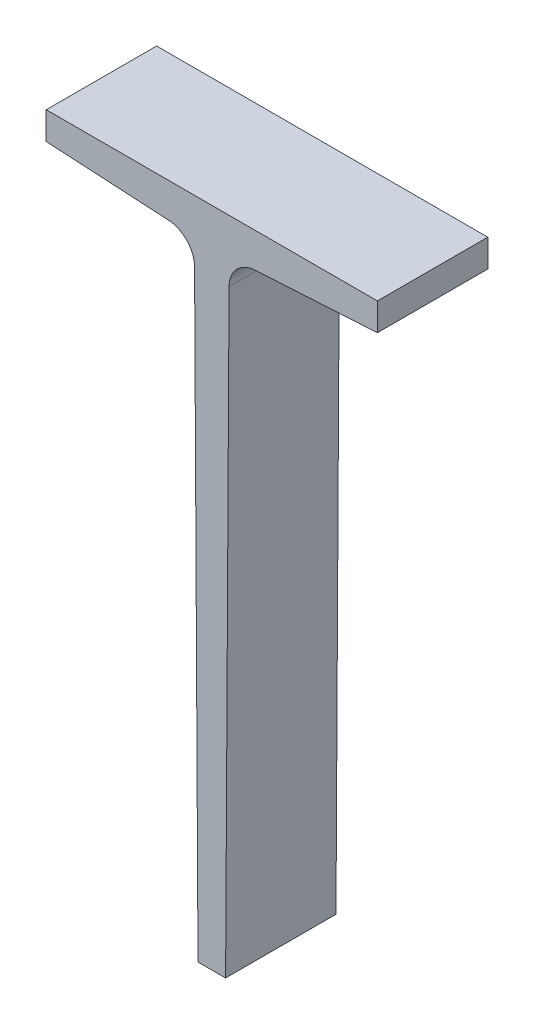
ISO-10303-21;
HEADER;
FILE_DESCRIPTION(('STEP AP214'),'2;1');
FILE_NAME('part.step','',(''),(''),'','','');
FILE_SCHEMA(('AUTOMOTIVE_DESIGN { 1 0 10303 214 1 1 1 1 }'));
ENDSEC;
DATA;
#1=APPLICATION_CONTEXT('core data for automotive mechanical design processes');
#2=APPLICATION_PROTOCOL_DEFINITION('international standard','automotive_design',2000,#1);
#3=PRODUCT_CONTEXT('',#1,'mechanical');
#4=PRODUCT('Part','Part','',(#3));
#5=PRODUCT_RELATED_PRODUCT_CATEGORY('part','',(#4));
#6=PRODUCT_DEFINITION_FORMATION('','',#4);
#7=PRODUCT_DEFINITION_CONTEXT('part definition',#1,'design');
#8=PRODUCT_DEFINITION('design','',#6,#7);
#9=PRODUCT_DEFINITION_SHAPE('','',#8);
#10=(LENGTH_UNIT() NAMED_UNIT(*) SI_UNIT(.MILLI.,.METRE.));
#11=(NAMED_UNIT(*) PLANE_ANGLE_UNIT() SI_UNIT($,.RADIAN.));
#12=(NAMED_UNIT(*) SI_UNIT($,.STERADIAN.) SOLID_ANGLE_UNIT());
#13=UNCERTAINTY_MEASURE_WITH_UNIT(LENGTH_MEASURE(1.E-05),#10,'distance_accuracy_value','');
#14=(GEOMETRIC_REPRESENTATION_CONTEXT(3) GLOBAL_UNCERTAINTY_ASSIGNED_CONTEXT((#13)) GLOBAL_UNIT_ASSIGNED_CONTEXT((#10,
#11,#12)) REPRESENTATION_CONTEXT('',''));
#15=CARTESIAN_POINT('',(0.,0.,0.));
#16=DIRECTION('',(0.,0.,1.));
#17=DIRECTION('',(1.,0.,0.));
#18=AXIS2_PLACEMENT_3D('',#15,#16,#17);
#19=CARTESIAN_POINT('',(0.,0.,12.7));
#20=DIRECTION('',(1.,0.,0.));
#21=DIRECTION('',(0.,1.,0.));
#22=AXIS2_PLACEMENT_3D('',#19,#20,#21);
#23=PLANE('',#22);
#24=DIRECTION('',(0.,-1.,0.));
#25=VECTOR('',#24,1.);
#26=CARTESIAN_POINT('',(0.,0.,-12.7));
#27=LINE('',#26,#25);
#28=CARTESIAN_POINT('',(0.,0.,-12.7));
#29=VERTEX_POINT('',#28);
#30=CARTESIAN_POINT('',(0.,-6.35,-12.7));
#31=VERTEX_POINT('',#30);
#32=EDGE_CURVE('E140',#29,#31,#27,.T.);
#33=ORIENTED_EDGE('',*,*,#32,.T.);
#34=DIRECTION('',(0.,0.,-1.));
#35=VECTOR('',#34,1.);
#36=CARTESIAN_POINT('',(0.,-6.35,12.7));
#37=LINE('',#36,#35);
#38=CARTESIAN_POINT('',(0.,-6.35,12.7));
#39=VERTEX_POINT('',#38);
#40=EDGE_CURVE('E11',#39,#31,#37,.T.);
#41=ORIENTED_EDGE('',*,*,#40,.F.);
#42=DIRECTION('',(0.,-1.,0.));
#43=VECTOR('',#42,1.);
#44=CARTESIAN_POINT('',(0.,0.,12.7));
#45=LINE('',#44,#43);
#46=CARTESIAN_POINT('',(0.,0.,12.7));
#47=VERTEX_POINT('',#46);
#48=EDGE_CURVE('E92',#47,#39,#45,.T.);
#49=ORIENTED_EDGE('',*,*,#48,.F.);
#50=DIRECTION('',(0.,0.,-1.));
#51=VECTOR('',#50,1.);
#52=CARTESIAN_POINT('',(0.,0.,12.7));
#53=LINE('',#52,#51);
#54=EDGE_CURVE('E49',#47,#29,#53,.T.);
#55=ORIENTED_EDGE('',*,*,#54,.T.);
#56=EDGE_LOOP('',(#33,#41,#49,#55));
#57=FACE_BOUND('',#56,.T.);
#58=ADVANCED_FACE('F33',(#57),#23,.F.);
#59=CARTESIAN_POINT('',(28.1390295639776,-7.9375,12.7));
#60=DIRECTION('',(-0.056326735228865,-0.998412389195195,0.));
#61=DIRECTION('',(0.998412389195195,-0.056326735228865,0.));
#62=AXIS2_PLACEMENT_3D('',#59,#60,#61);
#63=PLANE('',#62);
#64=DIRECTION('',(-0.998412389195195,0.056326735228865,0.));
#65=VECTOR('',#64,1.);
#66=CARTESIAN_POINT('',(28.1390295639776,-7.9375,-12.7));
#67=LINE('',#66,#65);
#68=CARTESIAN_POINT('',(28.1390295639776,-7.9375,-12.7));
#69=VERTEX_POINT('',#68);
#70=EDGE_CURVE('E142',#69,#31,#67,.T.);
#71=ORIENTED_EDGE('',*,*,#70,.F.);
#72=DIRECTION('',(0.,0.,-1.));
#73=VECTOR('',#72,1.);
#74=CARTESIAN_POINT('',(28.1390295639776,-7.9375,12.7));
#75=LINE('',#74,#73);
#76=CARTESIAN_POINT('',(28.1390295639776,-7.9375,12.7));
#77=VERTEX_POINT('',#76);
#78=EDGE_CURVE('E41',#77,#69,#75,.T.);
#79=ORIENTED_EDGE('',*,*,#78,.F.);
#80=DIRECTION('',(-0.998412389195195,0.056326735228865,0.));
#81=VECTOR('',#80,1.);
#82=CARTESIAN_POINT('',(28.1390295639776,-7.9375,12.7));
#83=LINE('',#82,#81);
#84=EDGE_CURVE('E196',#77,#39,#83,.T.);
#85=ORIENTED_EDGE('',*,*,#84,.T.);
#86=ORIENTED_EDGE('',*,*,#40,.T.);
#87=EDGE_LOOP('',(#71,#79,#85,#86));
#88=FACE_BOUND('',#87,.T.);
#89=ADVANCED_FACE('F185',(#88),#63,.T.);
#90=CARTESIAN_POINT('',(27.7813547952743,-14.2774186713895,12.7));
#91=DIRECTION('',(0.,0.,-1.));
#92=DIRECTION('',(-1.,0.,0.));
#93=AXIS2_PLACEMENT_3D('',#90,#91,#92);
#94=CYLINDRICAL_SURFACE('',#93,6.35);
#95=CARTESIAN_POINT('',(27.7813547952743,-14.2774186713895,-12.7));
#96=DIRECTION('',(0.,0.,1.));
#97=DIRECTION('',(1.,0.,0.));
#98=AXIS2_PLACEMENT_3D('',#95,#96,#97);
#99=CIRCLE('',#98,6.35);
#100=CARTESIAN_POINT('',(34.13125,-14.2409373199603,-12.7));
#101=VERTEX_POINT('',#100);
#102=EDGE_CURVE('E145',#101,#69,#99,.T.);
#103=ORIENTED_EDGE('',*,*,#102,.F.);
#104=DIRECTION('',(0.,0.,-1.));
#105=VECTOR('',#104,1.);
#106=CARTESIAN_POINT('',(34.13125,-14.2409373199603,12.7));
#107=LINE('',#106,#105);
#108=CARTESIAN_POINT('',(34.13125,-14.2409373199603,12.7));
#109=VERTEX_POINT('',#108);
#110=EDGE_CURVE('E175',#109,#101,#107,.T.);
#111=ORIENTED_EDGE('',*,*,#110,.F.);
#112=CARTESIAN_POINT('',(27.7813547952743,-14.2774186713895,12.7));
#113=DIRECTION('',(0.,0.,1.));
#114=DIRECTION('',(1.,0.,0.));
#115=AXIS2_PLACEMENT_3D('',#112,#113,#114);
#116=CIRCLE('',#115,6.35);
#117=EDGE_CURVE('E182',#109,#77,#116,.T.);
#118=ORIENTED_EDGE('',*,*,#117,.T.);
#119=ORIENTED_EDGE('',*,*,#78,.T.);
#120=EDGE_LOOP('',(#103,#111,#118,#119));
#121=FACE_BOUND('',#120,.T.);
#122=ADVANCED_FACE('F180',(#121),#94,.F.);
#123=CARTESIAN_POINT('',(34.925,-152.4,12.7));
#124=DIRECTION('',(-0.99998349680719,-0.00574509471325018,0.));
#125=DIRECTION('',(0.00574509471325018,-0.99998349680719,0.));
#126=AXIS2_PLACEMENT_3D('',#123,#124,#125);
#127=PLANE('',#126);
#128=DIRECTION('',(-0.00574509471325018,0.99998349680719,0.));
#129=VECTOR('',#128,1.);
#130=CARTESIAN_POINT('',(34.925,-152.4,-12.7));
#131=LINE('',#130,#129);
#132=CARTESIAN_POINT('',(34.925,-152.4,-12.7));
#133=VERTEX_POINT('',#132);
#134=EDGE_CURVE('E148',#133,#101,#131,.T.);
#135=ORIENTED_EDGE('',*,*,#134,.F.);
#136=DIRECTION('',(0.,0.,-1.));
#137=VECTOR('',#136,1.);
#138=CARTESIAN_POINT('',(34.925,-152.4,12.7));
#139=LINE('',#138,#137);
#140=CARTESIAN_POINT('',(34.925,-152.4,12.7));
#141=VERTEX_POINT('',#140);
#142=EDGE_CURVE('E173',#141,#133,#139,.T.);
#143=ORIENTED_EDGE('',*,*,#142,.F.);
#144=DIRECTION('',(-0.00574509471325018,0.99998349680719,0.));
#145=VECTOR('',#144,1.);
#146=CARTESIAN_POINT('',(34.925,-152.4,12.7));
#147=LINE('',#146,#145);
#148=EDGE_CURVE('E195',#141,#109,#147,.T.);
#149=ORIENTED_EDGE('',*,*,#148,.T.);
#150=ORIENTED_EDGE('',*,*,#110,.T.);
#151=EDGE_LOOP('',(#135,#143,#149,#150));
#152=FACE_BOUND('',#151,.T.);
#153=ADVANCED_FACE('F191',(#152),#127,.T.);
#154=CARTESIAN_POINT('',(34.925,-152.4,12.7));
#155=DIRECTION('',(0.,1.,0.));
#156=DIRECTION('',(0.,0.,1.));
#157=AXIS2_PLACEMENT_3D('',#154,#155,#156);
#158=PLANE('',#157);
#159=DIRECTION('',(1.,0.,0.));
#160=VECTOR('',#159,1.);
#161=CARTESIAN_POINT('',(34.925,-152.4,-12.7));
#162=LINE('',#161,#160);
#163=CARTESIAN_POINT('',(41.275,-152.4,-12.7));
#164=VERTEX_POINT('',#163);
#165=EDGE_CURVE('E151',#133,#164,#162,.T.);
#166=ORIENTED_EDGE('',*,*,#165,.T.);
#167=DIRECTION('',(0.,0.,-1.));
#168=VECTOR('',#167,1.);
#169=CARTESIAN_POINT('',(41.275,-152.4,12.7));
#170=LINE('',#169,#168);
#171=CARTESIAN_POINT('',(41.275,-152.4,12.7));
#172=VERTEX_POINT('',#171);
#173=EDGE_CURVE('E171',#172,#164,#170,.T.);
#174=ORIENTED_EDGE('',*,*,#173,.F.);
#175=DIRECTION('',(1.,0.,0.));
#176=VECTOR('',#175,1.);
#177=CARTESIAN_POINT('',(34.925,-152.4,12.7));
#178=LINE('',#177,#176);
#179=EDGE_CURVE('E198',#141,#172,#178,.T.);
#180=ORIENTED_EDGE('',*,*,#179,.F.);
#181=ORIENTED_EDGE('',*,*,#142,.T.);
#182=EDGE_LOOP('',(#166,#174,#180,#181));
#183=FACE_BOUND('',#182,.T.);
#184=ADVANCED_FACE('F231',(#183),#158,.F.);
#185=CARTESIAN_POINT('',(42.06875,-14.2409373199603,12.7));
#186=DIRECTION('',(0.99998349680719,-0.00574509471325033,0.));
#187=DIRECTION('',(0.00574509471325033,0.99998349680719,0.));
#188=AXIS2_PLACEMENT_3D('',#185,#186,#187);
#189=PLANE('',#188);
#190=DIRECTION('',(-0.00574509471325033,-0.99998349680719,0.));
#191=VECTOR('',#190,1.);
#192=CARTESIAN_POINT('',(42.06875,-14.2409373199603,-12.7));
#193=LINE('',#192,#191);
#194=CARTESIAN_POINT('',(42.06875,-14.2409373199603,-12.7));
#195=VERTEX_POINT('',#194);
#196=EDGE_CURVE('E154',#195,#164,#193,.T.);
#197=ORIENTED_EDGE('',*,*,#196,.F.);
#198=DIRECTION('',(0.,0.,-1.));
#199=VECTOR('',#198,1.);
#200=CARTESIAN_POINT('',(42.06875,-14.2409373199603,12.7));
#201=LINE('',#200,#199);
#202=CARTESIAN_POINT('',(42.06875,-14.2409373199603,12.7));
#203=VERTEX_POINT('',#202);
#204=EDGE_CURVE('E169',#203,#195,#201,.T.);
#205=ORIENTED_EDGE('',*,*,#204,.F.);
#206=DIRECTION('',(-0.00574509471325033,-0.99998349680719,0.));
#207=VECTOR('',#206,1.);
#208=CARTESIAN_POINT('',(42.06875,-14.2409373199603,12.7));
#209=LINE('',#208,#207);
#210=EDGE_CURVE('E204',#203,#172,#209,.T.);
#211=ORIENTED_EDGE('',*,*,#210,.T.);
#212=ORIENTED_EDGE('',*,*,#173,.T.);
#213=EDGE_LOOP('',(#197,#205,#211,#212));
#214=FACE_BOUND('',#213,.T.);
#215=ADVANCED_FACE('F234',(#214),#189,.T.);
#216=CARTESIAN_POINT('',(48.4186452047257,-14.2774186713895,12.7));
#217=DIRECTION('',(0.,0.,-1.));
#218=DIRECTION('',(-1.,0.,0.));
#219=AXIS2_PLACEMENT_3D('',#216,#217,#218);
#220=CYLINDRICAL_SURFACE('',#219,6.35);
#221=CARTESIAN_POINT('',(48.4186452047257,-14.2774186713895,-12.7));
#222=DIRECTION('',(0.,0.,1.));
#223=DIRECTION('',(1.,0.,0.));
#224=AXIS2_PLACEMENT_3D('',#221,#222,#223);
#225=CIRCLE('',#224,6.35);
#226=CARTESIAN_POINT('',(48.0609704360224,-7.9375,-12.7));
#227=VERTEX_POINT('',#226);
#228=EDGE_CURVE('E157',#227,#195,#225,.T.);
#229=ORIENTED_EDGE('',*,*,#228,.F.);
#230=DIRECTION('',(0.,0.,-1.));
#231=VECTOR('',#230,1.);
#232=CARTESIAN_POINT('',(48.0609704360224,-7.9375,12.7));
#233=LINE('',#232,#231);
#234=CARTESIAN_POINT('',(48.0609704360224,-7.9375,12.7));
#235=VERTEX_POINT('',#234);
#236=EDGE_CURVE('E124',#235,#227,#233,.T.);
#237=ORIENTED_EDGE('',*,*,#236,.F.);
#238=CARTESIAN_POINT('',(48.4186452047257,-14.2774186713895,12.7));
#239=DIRECTION('',(0.,0.,1.));
#240=DIRECTION('',(1.,0.,0.));
#241=AXIS2_PLACEMENT_3D('',#238,#239,#240);
#242=CIRCLE('',#241,6.35);
#243=EDGE_CURVE('E132',#235,#203,#242,.T.);
#244=ORIENTED_EDGE('',*,*,#243,.T.);
#245=ORIENTED_EDGE('',*,*,#204,.T.);
#246=EDGE_LOOP('',(#229,#237,#244,#245));
#247=FACE_BOUND('',#246,.T.);
#248=ADVANCED_FACE('F208',(#247),#220,.F.);
#249=CARTESIAN_POINT('',(76.2,-6.35,12.7));
#250=DIRECTION('',(0.056326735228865,-0.998412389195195,0.));
#251=DIRECTION('',(0.998412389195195,0.056326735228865,0.));
#252=AXIS2_PLACEMENT_3D('',#249,#250,#251);
#253=PLANE('',#252);
#254=DIRECTION('',(-0.998412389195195,-0.056326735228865,0.));
#255=VECTOR('',#254,1.);
#256=CARTESIAN_POINT('',(76.2,-6.35,-12.7));
#257=LINE('',#256,#255);
#258=CARTESIAN_POINT('',(76.2,-6.35,-12.7));
#259=VERTEX_POINT('',#258);
#260=EDGE_CURVE('E120',#259,#227,#257,.T.);
#261=ORIENTED_EDGE('',*,*,#260,.F.);
#262=DIRECTION('',(0.,0.,-1.));
#263=VECTOR('',#262,1.);
#264=CARTESIAN_POINT('',(76.2,-6.35,12.7));
#265=LINE('',#264,#263);
#266=CARTESIAN_POINT('',(76.2,-6.35,12.7));
#267=VERTEX_POINT('',#266);
#268=EDGE_CURVE('E115',#267,#259,#265,.T.);
#269=ORIENTED_EDGE('',*,*,#268,.F.);
#270=DIRECTION('',(-0.998412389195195,-0.056326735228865,0.));
#271=VECTOR('',#270,1.);
#272=CARTESIAN_POINT('',(76.2,-6.35,12.7));
#273=LINE('',#272,#271);
#274=EDGE_CURVE('E118',#267,#235,#273,.T.);
#275=ORIENTED_EDGE('',*,*,#274,.T.);
#276=ORIENTED_EDGE('',*,*,#236,.T.);
#277=EDGE_LOOP('',(#261,#269,#275,#276));
#278=FACE_BOUND('',#277,.T.);
#279=ADVANCED_FACE('F117',(#278),#253,.T.);
#280=CARTESIAN_POINT('',(76.2,0.,12.7));
#281=DIRECTION('',(1.,0.,0.));
#282=DIRECTION('',(0.,0.,-1.));
#283=AXIS2_PLACEMENT_3D('',#280,#281,#282);
#284=PLANE('',#283);
#285=DIRECTION('',(0.,-1.,0.));
#286=VECTOR('',#285,1.);
#287=CARTESIAN_POINT('',(76.2,0.,-12.7));
#288=LINE('',#287,#286);
#289=CARTESIAN_POINT('',(76.2,0.,-12.7));
#290=VERTEX_POINT('',#289);
#291=EDGE_CURVE('E161',#290,#259,#288,.T.);
#292=ORIENTED_EDGE('',*,*,#291,.F.);
#293=DIRECTION('',(0.,0.,-1.));
#294=VECTOR('',#293,1.);
#295=CARTESIAN_POINT('',(76.2,0.,12.7));
#296=LINE('',#295,#294);
#297=CARTESIAN_POINT('',(76.2,0.,12.7));
#298=VERTEX_POINT('',#297);
#299=EDGE_CURVE('E80',#298,#290,#296,.T.);
#300=ORIENTED_EDGE('',*,*,#299,.F.);
#301=DIRECTION('',(0.,-1.,0.));
#302=VECTOR('',#301,1.);
#303=CARTESIAN_POINT('',(76.2,0.,12.7));
#304=LINE('',#303,#302);
#305=EDGE_CURVE('E129',#298,#267,#304,.T.);
#306=ORIENTED_EDGE('',*,*,#305,.T.);
#307=ORIENTED_EDGE('',*,*,#268,.T.);
#308=EDGE_LOOP('',(#292,#300,#306,#307));
#309=FACE_BOUND('',#308,.T.);
#310=ADVANCED_FACE('F134',(#309),#284,.T.);
#311=CARTESIAN_POINT('',(0.,0.,12.7));
#312=DIRECTION('',(0.,1.,0.));
#313=DIRECTION('',(-1.,0.,0.));
#314=AXIS2_PLACEMENT_3D('',#311,#312,#313);
#315=PLANE('',#314);
#316=DIRECTION('',(1.,0.,0.));
#317=VECTOR('',#316,1.);
#318=CARTESIAN_POINT('',(0.,0.,-12.7));
#319=LINE('',#318,#317);
#320=EDGE_CURVE('E163',#29,#290,#319,.T.);
#321=ORIENTED_EDGE('',*,*,#320,.F.);
#322=ORIENTED_EDGE('',*,*,#54,.F.);
#323=DIRECTION('',(1.,0.,0.));
#324=VECTOR('',#323,1.);
#325=CARTESIAN_POINT('',(0.,0.,12.7));
#326=LINE('',#325,#324);
#327=EDGE_CURVE('E135',#47,#298,#326,.T.);
#328=ORIENTED_EDGE('',*,*,#327,.T.);
#329=ORIENTED_EDGE('',*,*,#299,.T.);
#330=EDGE_LOOP('',(#321,#322,#328,#329));
#331=FACE_BOUND('',#330,.T.);
#332=ADVANCED_FACE('F210',(#331),#315,.T.);
#333=CARTESIAN_POINT('',(27.7813547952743,-14.2774186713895,12.7));
#334=DIRECTION('',(0.,0.,1.));
#335=DIRECTION('',(1.,0.,0.));
#336=AXIS2_PLACEMENT_3D('',#333,#334,#335);
#337=PLANE('',#336);
#338=ORIENTED_EDGE('',*,*,#48,.T.);
#339=ORIENTED_EDGE('',*,*,#84,.F.);
#340=ORIENTED_EDGE('',*,*,#117,.F.);
#341=ORIENTED_EDGE('',*,*,#148,.F.);
#342=ORIENTED_EDGE('',*,*,#179,.T.);
#343=ORIENTED_EDGE('',*,*,#210,.F.);
#344=ORIENTED_EDGE('',*,*,#243,.F.);
#345=ORIENTED_EDGE('',*,*,#274,.F.);
#346=ORIENTED_EDGE('',*,*,#305,.F.);
#347=ORIENTED_EDGE('',*,*,#327,.F.);
#348=EDGE_LOOP('',(#338,#339,#340,#341,#342,#343,#344,#345,#346,#347));
#349=FACE_BOUND('',#348,.T.);
#350=ADVANCED_FACE('F128',(#349),#337,.T.);
#351=CARTESIAN_POINT('',(27.7813547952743,-14.2774186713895,-12.7));
#352=DIRECTION('',(0.,0.,1.));
#353=DIRECTION('',(1.,0.,0.));
#354=AXIS2_PLACEMENT_3D('',#351,#352,#353);
#355=PLANE('',#354);
#356=ORIENTED_EDGE('',*,*,#32,.F.);
#357=ORIENTED_EDGE('',*,*,#320,.T.);
#358=ORIENTED_EDGE('',*,*,#291,.T.);
#359=ORIENTED_EDGE('',*,*,#260,.T.);
#360=ORIENTED_EDGE('',*,*,#228,.T.);
#361=ORIENTED_EDGE('',*,*,#196,.T.);
#362=ORIENTED_EDGE('',*,*,#165,.F.);
#363=ORIENTED_EDGE('',*,*,#134,.T.);
#364=ORIENTED_EDGE('',*,*,#102,.T.);
#365=ORIENTED_EDGE('',*,*,#70,.T.);
#366=EDGE_LOOP('',(#356,#357,#358,#359,#360,#361,#362,#363,#364,#365));
#367=FACE_BOUND('',#366,.T.);
#368=ADVANCED_FACE('F187',(#367),#355,.F.);
#369=CLOSED_SHELL('',(#58,#89,#122,#153,#184,#215,#248,#279,#310,#332,#350,#368));
#370=MANIFOLD_SOLID_BREP('B2',#369);
#371=ADVANCED_BREP_SHAPE_REPRESENTATION('',(#18,#370),#14);
#372=SHAPE_DEFINITION_REPRESENTATION(#9,#371);
ENDSEC;
END-ISO-10303-21;
